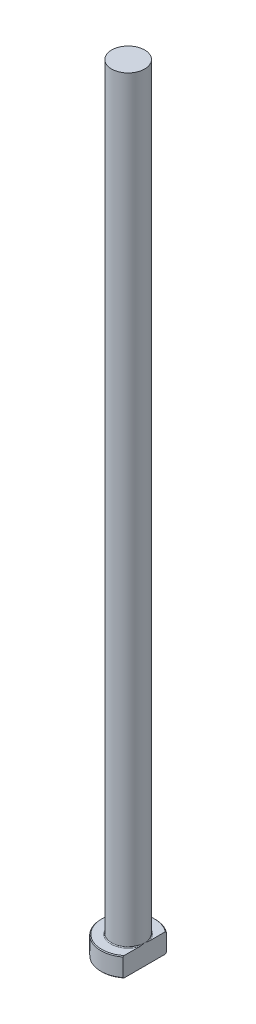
from build123d import *
from build123d.topology import SkipClean

# Parameters (mm, degrees)
CHAMFER1_SIZE = 0.2
FILLET1_R     = 0.2
KEY_DEPTH     = 201.244850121


with BuildPart() as part:
    # Sketch1 → Revolve1 (revolve)
    with BuildSketch(Plane.XY, mode=Mode.PRIVATE) as revolve1_sk:
        Polygon((0, 0), (-7, 0), (-7, 5), (-4.25, 5), (-4.25, 200), (0, 200), align=None)
    revolve(revolve1_sk.sketch.rotate(Axis((0, 259.958771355, 0), (0, -1, 0)), 270), axis=Axis((0, 259.958771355, 0), (0, -1, 0)))

    # Chamfer1
    chamfer1_edges = [part.edges().sort_by_distance(p)[0] for p in [
        (0, 5, -7),
        (0, 0, -7),
    ]]
    chamfer(chamfer1_edges, length=CHAMFER1_SIZE)

    # Fillet1
    fillet1_edges = [part.edges().sort_by_distance(p)[0] for p in [
        (0, 5, -4.25),
    ]]
    fillet(fillet1_edges, radius=FILLET1_R)

    # Sketch2 → KEY (cut, through all)
    with SkipClean():  # the faces are left unmerged after this step: merging them gives an invalid solid
        with BuildSketch(Plane(origin=(0, 0, 0), x_dir=(1, 0, 0), z_dir=(0, 1, 0))):
            with BuildLine():
                Line((4.25, 5.562148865), (4.25, -5.562148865))
                ThreePointArc((4.25, -5.562148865), (7, 0), (4.25, 5.562148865))
            make_face()
        extrude(amount=KEY_DEPTH, mode=Mode.SUBTRACT)


solid = part.part
